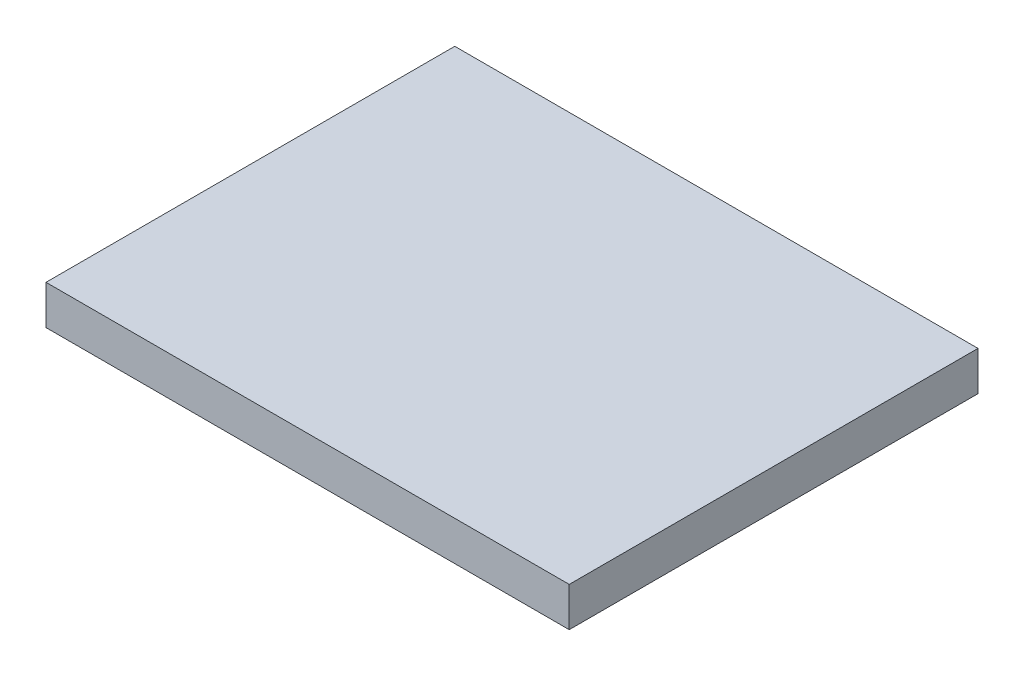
from build123d import *

# Parameters (mm, degrees)
SKETCH1_W           = 80
SKETCH1_H           = 62.5
BOSS_EXTRUDE1_DEPTH = 6


with BuildPart() as part:
    # Sketch1 → Boss-Extrude1 (new body)
    with BuildSketch(Plane(origin=(0, 0, 0), x_dir=(1, 0, 0), z_dir=(0, 1, 0))):
        Rectangle(SKETCH1_W, SKETCH1_H)
    extrude(amount=BOSS_EXTRUDE1_DEPTH)


solid = part.part
